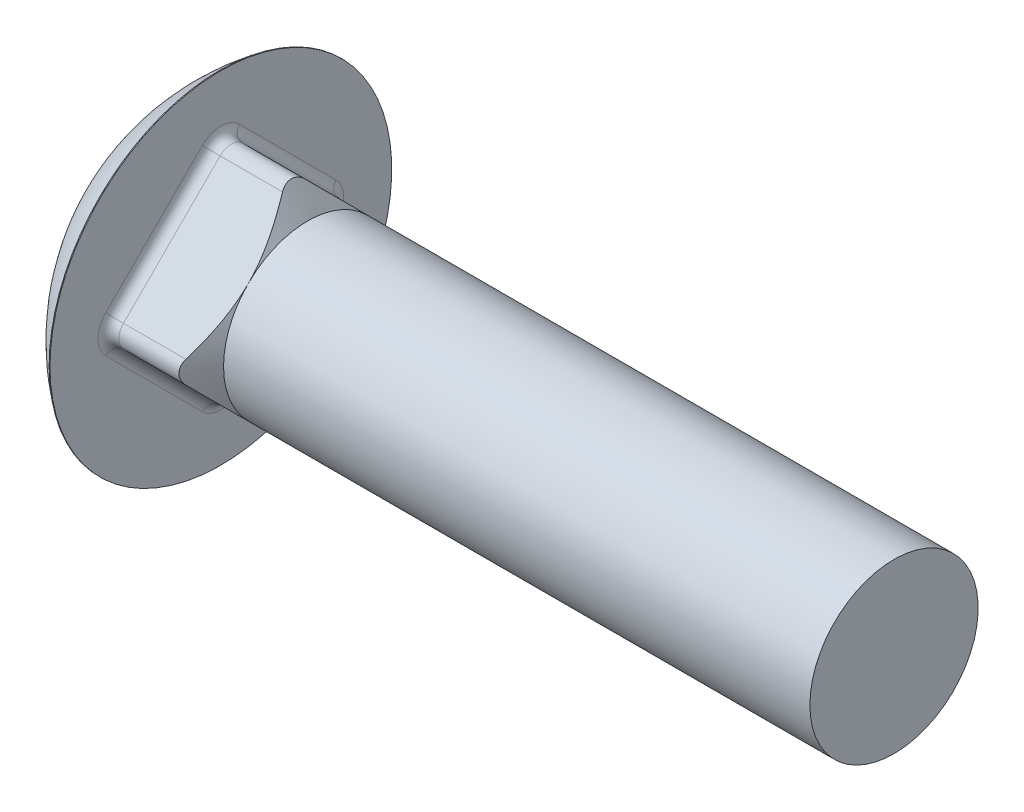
from build123d import *

# Parameters (mm, degrees)
NECK_DEPTH   = 13.1064
NECKFILLET_R = 1.5748


with BuildPart() as part:
    # BodySke → Base-Revolve (revolve)
    with BuildSketch(Plane.XY, mode=Mode.PRIVATE) as base_revolve_sk:
        with BuildLine():
            Line((0, 0), (114.7064, 0))
            Line((114.7064, 0), (114.7064, 12.7))
            Line((114.7064, 12.7), (13.1064, 12.7))
            Line((13.1064, 12.7), (13.1064, 25.7937))
            Line((13.1064, 25.7937), (12.9794, 25.7937))
            ThreePointArc((12.9794, 25.7937), (3.427753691, 14.437622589), (0, 0))
        make_face()
    revolve(base_revolve_sk.sketch.rotate(Axis((0, 0, 0), (1, 0, 0)), 90), axis=Axis((0, 0, 0), (1, 0, 0)))

    # Sketch2 → Neck (add)
    with BuildSketch(Plane(origin=(13.1064, 0, 0), x_dir=(0, -0.7071067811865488, -0.7071067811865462), z_dir=(1, 0, 0))):
        with BuildLine():
            Line((10.3124, -12.7), (-10.3124, -12.7))
            ThreePointArc((-10.3124, -12.7), (-12.000688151, -12.000688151), (-12.7, -10.3124))
            Line((-12.7, -10.3124), (-12.7, 10.3124))
            ThreePointArc((-12.7, 10.3124), (-12.000688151, 12.000688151), (-10.3124, 12.7))
            Line((-10.3124, 12.7), (10.3124, 12.7))
            ThreePointArc((10.3124, 12.7), (12.000688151, 12.000688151), (12.7, 10.3124))
            Line((12.7, 10.3124), (12.7, -10.3124))
            ThreePointArc((12.7, -10.3124), (12.000688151, -12.000688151), (10.3124, -12.7))
        make_face()
    extrude(amount=NECK_DEPTH)

    # NeckFillet
    neckfillet_edges = [part.edges().sort_by_distance(p)[0] for p in [
        (13.1064, 8.980256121, -8.980256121),
        (13.1064, -8.980256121, -8.980256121),
        (13.1064, -8.980256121, 8.980256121),
        (13.1064, 8.980256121, 8.980256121),
        (13.1064, 16.971535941, 0),
        (13.1064, 0, 16.971535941),
        (13.1064, -16.971535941, 0),
        (13.1064, 0, -16.971535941),
    ]]
    fillet(neckfillet_edges, radius=NECKFILLET_R)

    # Sketch3 → Cut-Revolve1 (revolve, cut)
    with BuildSketch(Plane.XY):
        Polygon((26.2128, 12.7), (13.1064, 35.400950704), (13.1064, 38.4937), (38.9128, 38.4937), (38.9128, 12.7), align=None)
    revolve(axis=Axis((0, 0, 0), (1, 0, 0)), mode=Mode.SUBTRACT)


solid = part.part
